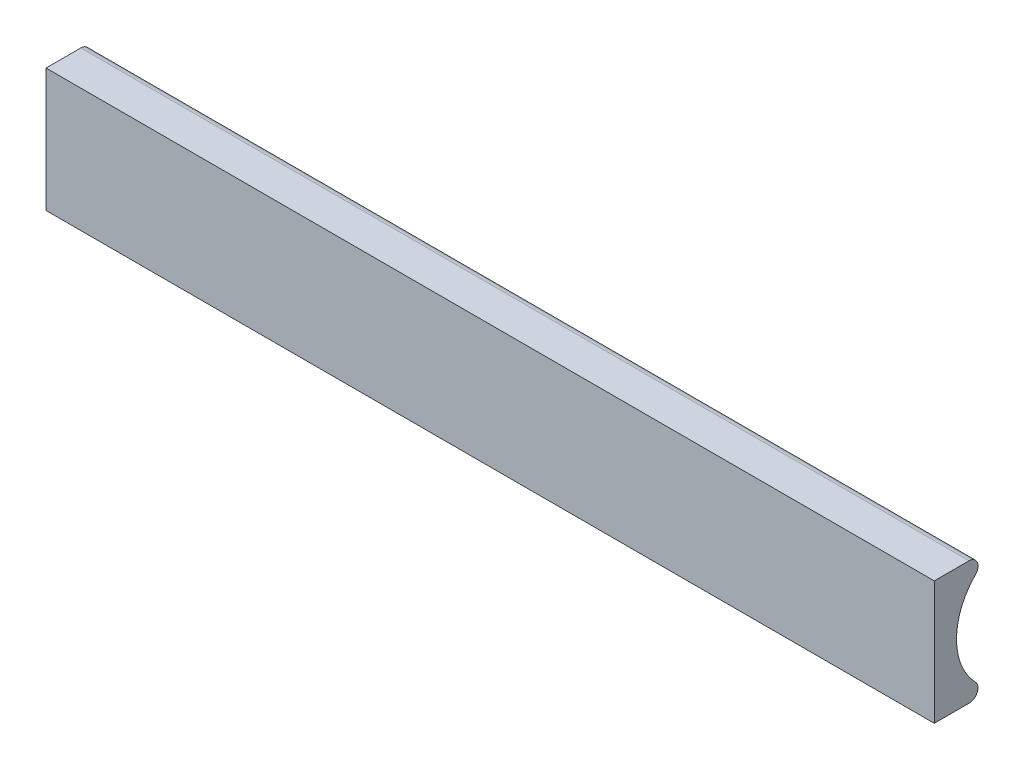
ISO-10303-21;
HEADER;
FILE_DESCRIPTION(('STEP AP214'),'2;1');
FILE_NAME('part.step','',(''),(''),'','','');
FILE_SCHEMA(('AUTOMOTIVE_DESIGN { 1 0 10303 214 1 1 1 1 }'));
ENDSEC;
DATA;
#1=APPLICATION_CONTEXT('core data for automotive mechanical design processes');
#2=APPLICATION_PROTOCOL_DEFINITION('international standard','automotive_design',2000,#1);
#3=PRODUCT_CONTEXT('',#1,'mechanical');
#4=PRODUCT('Part','Part','',(#3));
#5=PRODUCT_RELATED_PRODUCT_CATEGORY('part','',(#4));
#6=PRODUCT_DEFINITION_FORMATION('','',#4);
#7=PRODUCT_DEFINITION_CONTEXT('part definition',#1,'design');
#8=PRODUCT_DEFINITION('design','',#6,#7);
#9=PRODUCT_DEFINITION_SHAPE('','',#8);
#10=(LENGTH_UNIT() NAMED_UNIT(*) SI_UNIT(.MILLI.,.METRE.));
#11=(NAMED_UNIT(*) PLANE_ANGLE_UNIT() SI_UNIT($,.RADIAN.));
#12=(NAMED_UNIT(*) SI_UNIT($,.STERADIAN.) SOLID_ANGLE_UNIT());
#13=UNCERTAINTY_MEASURE_WITH_UNIT(LENGTH_MEASURE(1.E-05),#10,'distance_accuracy_value','');
#14=(GEOMETRIC_REPRESENTATION_CONTEXT(3) GLOBAL_UNCERTAINTY_ASSIGNED_CONTEXT((#13)) GLOBAL_UNIT_ASSIGNED_CONTEXT((#10,
#11,#12)) REPRESENTATION_CONTEXT('',''));
#15=CARTESIAN_POINT('',(0.,0.,0.));
#16=DIRECTION('',(0.,0.,1.));
#17=DIRECTION('',(1.,0.,0.));
#18=AXIS2_PLACEMENT_3D('',#15,#16,#17);
#19=CARTESIAN_POINT('',(-14.,1.38875,-2.));
#20=DIRECTION('',(-1.,0.,0.));
#21=DIRECTION('',(0.,0.,1.));
#22=AXIS2_PLACEMENT_3D('',#19,#20,#21);
#23=PLANE('',#22);
#24=CARTESIAN_POINT('',(-14.,0.,-2.));
#25=DIRECTION('',(-1.,0.,0.));
#26=DIRECTION('',(0.,0.,1.));
#27=AXIS2_PLACEMENT_3D('',#24,#25,#26);
#28=CIRCLE('',#27,1.5);
#29=CARTESIAN_POINT('',(-14.,-1.04889705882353,-0.927705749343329));
#30=VERTEX_POINT('',#29);
#31=CARTESIAN_POINT('',(-14.,1.04889705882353,-0.927705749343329));
#32=VERTEX_POINT('',#31);
#33=EDGE_CURVE('E110',#30,#32,#28,.T.);
#34=ORIENTED_EDGE('',*,*,#33,.F.);
#35=CARTESIAN_POINT('',(-14.,-1.18875,-0.784733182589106));
#36=DIRECTION('',(-1.,0.,0.));
#37=DIRECTION('',(0.,0.,1.));
#38=AXIS2_PLACEMENT_3D('',#35,#36,#37);
#39=CIRCLE('',#38,0.2);
#40=CARTESIAN_POINT('',(-14.,-1.38875,-0.784733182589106));
#41=VERTEX_POINT('',#40);
#42=EDGE_CURVE('E94',#30,#41,#39,.T.);
#43=ORIENTED_EDGE('',*,*,#42,.T.);
#44=DIRECTION('',(0.,0.,1.));
#45=VECTOR('',#44,1.);
#46=CARTESIAN_POINT('',(-14.,-1.38875,-2.));
#47=LINE('',#46,#45);
#48=CARTESIAN_POINT('',(-14.,-1.38875,0.));
#49=VERTEX_POINT('',#48);
#50=EDGE_CURVE('E87',#41,#49,#47,.T.);
#51=ORIENTED_EDGE('',*,*,#50,.T.);
#52=DIRECTION('',(0.,-1.,0.));
#53=VECTOR('',#52,1.);
#54=CARTESIAN_POINT('',(-14.,1.38875,0.));
#55=LINE('',#54,#53);
#56=CARTESIAN_POINT('',(-14.,1.38875,0.));
#57=VERTEX_POINT('',#56);
#58=EDGE_CURVE('E92',#57,#49,#55,.T.);
#59=ORIENTED_EDGE('',*,*,#58,.F.);
#60=DIRECTION('',(0.,0.,1.));
#61=VECTOR('',#60,1.);
#62=CARTESIAN_POINT('',(-14.,1.38875,-2.));
#63=LINE('',#62,#61);
#64=CARTESIAN_POINT('',(-14.,1.38875,-0.784733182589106));
#65=VERTEX_POINT('',#64);
#66=EDGE_CURVE('E116',#65,#57,#63,.T.);
#67=ORIENTED_EDGE('',*,*,#66,.F.);
#68=CARTESIAN_POINT('',(-14.,1.18875,-0.784733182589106));
#69=DIRECTION('',(-1.,0.,0.));
#70=DIRECTION('',(0.,0.,1.));
#71=AXIS2_PLACEMENT_3D('',#68,#69,#70);
#72=CIRCLE('',#71,0.2);
#73=EDGE_CURVE('E127',#65,#32,#72,.T.);
#74=ORIENTED_EDGE('',*,*,#73,.T.);
#75=EDGE_LOOP('',(#34,#43,#51,#59,#67,#74));
#76=FACE_BOUND('',#75,.T.);
#77=ADVANCED_FACE('F35',(#76),#23,.T.);
#78=CARTESIAN_POINT('',(6.,1.38875,-2.));
#79=DIRECTION('',(0.,1.,0.));
#80=DIRECTION('',(0.,0.,1.));
#81=AXIS2_PLACEMENT_3D('',#78,#79,#80);
#82=PLANE('',#81);
#83=DIRECTION('',(0.,0.,1.));
#84=VECTOR('',#83,1.);
#85=CARTESIAN_POINT('',(6.,1.38875,-2.));
#86=LINE('',#85,#84);
#87=CARTESIAN_POINT('',(6.,1.38875,-0.784733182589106));
#88=VERTEX_POINT('',#87);
#89=CARTESIAN_POINT('',(6.,1.38875,0.));
#90=VERTEX_POINT('',#89);
#91=EDGE_CURVE('E119',#88,#90,#86,.T.);
#92=ORIENTED_EDGE('',*,*,#91,.F.);
#93=DIRECTION('',(1.,0.,0.));
#94=VECTOR('',#93,1.);
#95=CARTESIAN_POINT('',(-14.,1.38875,-0.784733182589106));
#96=LINE('',#95,#94);
#97=EDGE_CURVE('E11',#88,#65,#96,.F.);
#98=ORIENTED_EDGE('',*,*,#97,.T.);
#99=ORIENTED_EDGE('',*,*,#66,.T.);
#100=DIRECTION('',(-1.,0.,0.));
#101=VECTOR('',#100,1.);
#102=CARTESIAN_POINT('',(6.,1.38875,0.));
#103=LINE('',#102,#101);
#104=EDGE_CURVE('E96',#90,#57,#103,.T.);
#105=ORIENTED_EDGE('',*,*,#104,.F.);
#106=EDGE_LOOP('',(#92,#98,#99,#105));
#107=FACE_BOUND('',#106,.T.);
#108=ADVANCED_FACE('F150',(#107),#82,.T.);
#109=CARTESIAN_POINT('',(6.,-1.38875,-2.));
#110=DIRECTION('',(1.,0.,0.));
#111=DIRECTION('',(0.,0.,-1.));
#112=AXIS2_PLACEMENT_3D('',#109,#110,#111);
#113=PLANE('',#112);
#114=DIRECTION('',(0.,0.,1.));
#115=VECTOR('',#114,1.);
#116=CARTESIAN_POINT('',(6.,-1.38875,-2.));
#117=LINE('',#116,#115);
#118=CARTESIAN_POINT('',(6.,-1.38875,-0.784733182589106));
#119=VERTEX_POINT('',#118);
#120=CARTESIAN_POINT('',(6.,-1.38875,0.));
#121=VERTEX_POINT('',#120);
#122=EDGE_CURVE('E95',#119,#121,#117,.T.);
#123=ORIENTED_EDGE('',*,*,#122,.F.);
#124=CARTESIAN_POINT('',(6.,-1.18875,-0.784733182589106));
#125=DIRECTION('',(1.,0.,0.));
#126=DIRECTION('',(0.,0.,-1.));
#127=AXIS2_PLACEMENT_3D('',#124,#125,#126);
#128=CIRCLE('',#127,0.2);
#129=CARTESIAN_POINT('',(6.,-1.04889705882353,-0.927705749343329));
#130=VERTEX_POINT('',#129);
#131=EDGE_CURVE('E43',#119,#130,#128,.T.);
#132=ORIENTED_EDGE('',*,*,#131,.T.);
#133=CARTESIAN_POINT('',(6.,0.,-2.));
#134=DIRECTION('',(-1.,0.,0.));
#135=DIRECTION('',(0.,0.,1.));
#136=AXIS2_PLACEMENT_3D('',#133,#134,#135);
#137=CIRCLE('',#136,1.5);
#138=CARTESIAN_POINT('',(6.,1.04889705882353,-0.927705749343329));
#139=VERTEX_POINT('',#138);
#140=EDGE_CURVE('E108',#130,#139,#137,.T.);
#141=ORIENTED_EDGE('',*,*,#140,.T.);
#142=CARTESIAN_POINT('',(6.,1.18875,-0.784733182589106));
#143=DIRECTION('',(1.,0.,0.));
#144=DIRECTION('',(0.,0.,-1.));
#145=AXIS2_PLACEMENT_3D('',#142,#143,#144);
#146=CIRCLE('',#145,0.2);
#147=EDGE_CURVE('E50',#139,#88,#146,.T.);
#148=ORIENTED_EDGE('',*,*,#147,.T.);
#149=ORIENTED_EDGE('',*,*,#91,.T.);
#150=DIRECTION('',(0.,1.,0.));
#151=VECTOR('',#150,1.);
#152=CARTESIAN_POINT('',(6.,-1.38875,0.));
#153=LINE('',#152,#151);
#154=EDGE_CURVE('E104',#121,#90,#153,.T.);
#155=ORIENTED_EDGE('',*,*,#154,.F.);
#156=EDGE_LOOP('',(#123,#132,#141,#148,#149,#155));
#157=FACE_BOUND('',#156,.T.);
#158=ADVANCED_FACE('F133',(#157),#113,.T.);
#159=CARTESIAN_POINT('',(-14.,-1.38875,-2.));
#160=DIRECTION('',(0.,-1.,0.));
#161=DIRECTION('',(0.,0.,-1.));
#162=AXIS2_PLACEMENT_3D('',#159,#160,#161);
#163=PLANE('',#162);
#164=ORIENTED_EDGE('',*,*,#50,.F.);
#165=DIRECTION('',(1.,0.,0.));
#166=VECTOR('',#165,1.);
#167=CARTESIAN_POINT('',(6.,-1.38875,-0.784733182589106));
#168=LINE('',#167,#166);
#169=EDGE_CURVE('E58',#41,#119,#168,.T.);
#170=ORIENTED_EDGE('',*,*,#169,.T.);
#171=ORIENTED_EDGE('',*,*,#122,.T.);
#172=DIRECTION('',(1.,0.,0.));
#173=VECTOR('',#172,1.);
#174=CARTESIAN_POINT('',(-14.,-1.38875,0.));
#175=LINE('',#174,#173);
#176=EDGE_CURVE('E99',#49,#121,#175,.T.);
#177=ORIENTED_EDGE('',*,*,#176,.F.);
#178=EDGE_LOOP('',(#164,#170,#171,#177));
#179=FACE_BOUND('',#178,.T.);
#180=ADVANCED_FACE('F100',(#179),#163,.T.);
#181=CARTESIAN_POINT('',(0.,0.,0.));
#182=DIRECTION('',(0.,0.,1.));
#183=DIRECTION('',(1.,0.,0.));
#184=AXIS2_PLACEMENT_3D('',#181,#182,#183);
#185=PLANE('',#184);
#186=ORIENTED_EDGE('',*,*,#58,.T.);
#187=ORIENTED_EDGE('',*,*,#176,.T.);
#188=ORIENTED_EDGE('',*,*,#154,.T.);
#189=ORIENTED_EDGE('',*,*,#104,.T.);
#190=EDGE_LOOP('',(#186,#187,#188,#189));
#191=FACE_BOUND('',#190,.T.);
#192=ADVANCED_FACE('F106',(#191),#185,.T.);
#193=CARTESIAN_POINT('',(6.,0.,-2.));
#194=DIRECTION('',(-1.,0.,0.));
#195=DIRECTION('',(0.,0.,1.));
#196=AXIS2_PLACEMENT_3D('',#193,#194,#195);
#197=CYLINDRICAL_SURFACE('',#196,1.5);
#198=ORIENTED_EDGE('',*,*,#140,.F.);
#199=DIRECTION('',(-1.,0.,0.));
#200=VECTOR('',#199,1.);
#201=CARTESIAN_POINT('',(6.,-1.04889705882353,-0.927705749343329));
#202=LINE('',#201,#200);
#203=EDGE_CURVE('E124',#130,#30,#202,.T.);
#204=ORIENTED_EDGE('',*,*,#203,.T.);
#205=ORIENTED_EDGE('',*,*,#33,.T.);
#206=DIRECTION('',(-1.,0.,0.));
#207=VECTOR('',#206,1.);
#208=CARTESIAN_POINT('',(6.,1.04889705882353,-0.927705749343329));
#209=LINE('',#208,#207);
#210=EDGE_CURVE('E118',#32,#139,#209,.F.);
#211=ORIENTED_EDGE('',*,*,#210,.T.);
#212=EDGE_LOOP('',(#198,#204,#205,#211));
#213=FACE_BOUND('',#212,.T.);
#214=ADVANCED_FACE('F137',(#213),#197,.F.);
#215=CARTESIAN_POINT('',(6.,-1.18875,-0.784733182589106));
#216=DIRECTION('',(-1.,0.,0.));
#217=DIRECTION('',(0.,0.,1.));
#218=AXIS2_PLACEMENT_3D('',#215,#216,#217);
#219=CYLINDRICAL_SURFACE('',#218,0.2);
#220=ORIENTED_EDGE('',*,*,#131,.F.);
#221=ORIENTED_EDGE('',*,*,#169,.F.);
#222=ORIENTED_EDGE('',*,*,#42,.F.);
#223=ORIENTED_EDGE('',*,*,#203,.F.);
#224=EDGE_LOOP('',(#220,#221,#222,#223));
#225=FACE_BOUND('',#224,.T.);
#226=ADVANCED_FACE('F140',(#225),#219,.T.);
#227=CARTESIAN_POINT('',(6.,1.18875,-0.784733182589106));
#228=DIRECTION('',(-1.,0.,0.));
#229=DIRECTION('',(0.,0.,1.));
#230=AXIS2_PLACEMENT_3D('',#227,#228,#229);
#231=CYLINDRICAL_SURFACE('',#230,0.2);
#232=ORIENTED_EDGE('',*,*,#73,.F.);
#233=ORIENTED_EDGE('',*,*,#97,.F.);
#234=ORIENTED_EDGE('',*,*,#147,.F.);
#235=ORIENTED_EDGE('',*,*,#210,.F.);
#236=EDGE_LOOP('',(#232,#233,#234,#235));
#237=FACE_BOUND('',#236,.T.);
#238=ADVANCED_FACE('F37',(#237),#231,.T.);
#239=CLOSED_SHELL('',(#77,#108,#158,#180,#192,#214,#226,#238));
#240=MANIFOLD_SOLID_BREP('B2',#239);
#241=ADVANCED_BREP_SHAPE_REPRESENTATION('',(#18,#240),#14);
#242=SHAPE_DEFINITION_REPRESENTATION(#9,#241);
ENDSEC;
END-ISO-10303-21;
